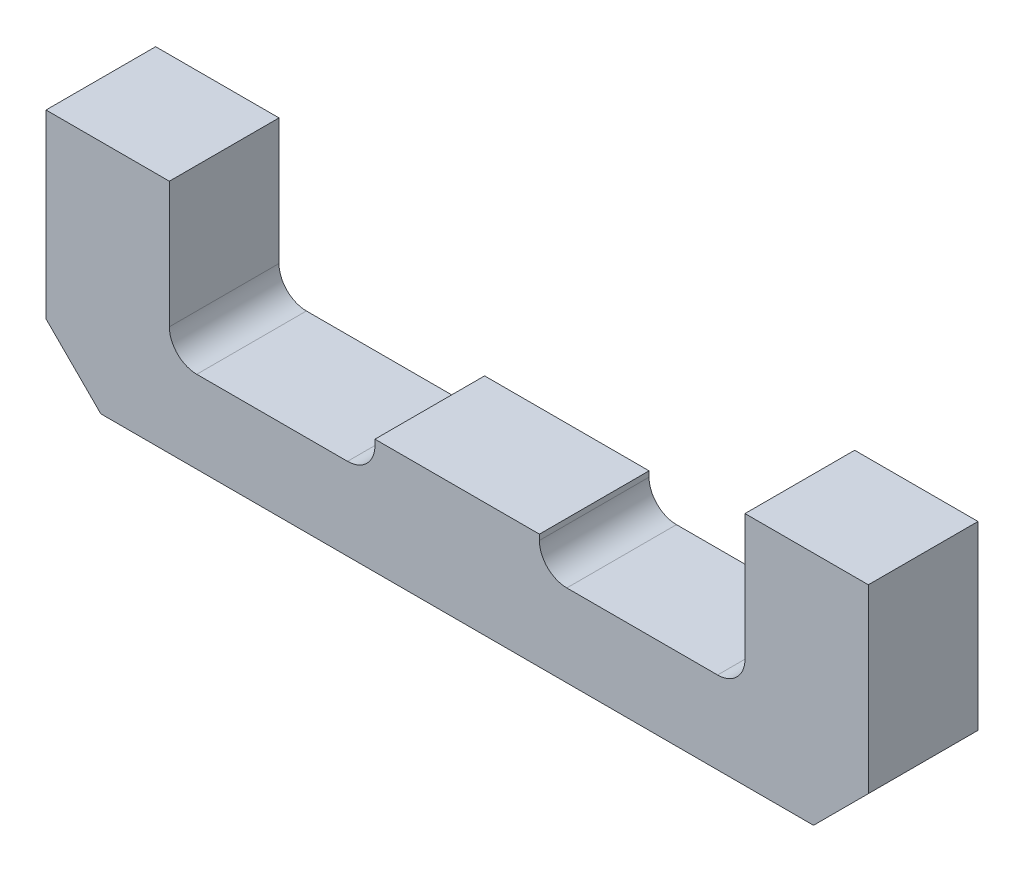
ISO-10303-21;
HEADER;
FILE_DESCRIPTION(('STEP AP214'),'2;1');
FILE_NAME('part.step','',(''),(''),'','','');
FILE_SCHEMA(('AUTOMOTIVE_DESIGN { 1 0 10303 214 1 1 1 1 }'));
ENDSEC;
DATA;
#1=APPLICATION_CONTEXT('core data for automotive mechanical design processes');
#2=APPLICATION_PROTOCOL_DEFINITION('international standard','automotive_design',2000,#1);
#3=PRODUCT_CONTEXT('',#1,'mechanical');
#4=PRODUCT('Part','Part','',(#3));
#5=PRODUCT_RELATED_PRODUCT_CATEGORY('part','',(#4));
#6=PRODUCT_DEFINITION_FORMATION('','',#4);
#7=PRODUCT_DEFINITION_CONTEXT('part definition',#1,'design');
#8=PRODUCT_DEFINITION('design','',#6,#7);
#9=PRODUCT_DEFINITION_SHAPE('','',#8);
#10=(LENGTH_UNIT() NAMED_UNIT(*) SI_UNIT(.MILLI.,.METRE.));
#11=(NAMED_UNIT(*) PLANE_ANGLE_UNIT() SI_UNIT($,.RADIAN.));
#12=(NAMED_UNIT(*) SI_UNIT($,.STERADIAN.) SOLID_ANGLE_UNIT());
#13=UNCERTAINTY_MEASURE_WITH_UNIT(LENGTH_MEASURE(1.E-05),#10,'distance_accuracy_value','');
#14=(GEOMETRIC_REPRESENTATION_CONTEXT(3) GLOBAL_UNCERTAINTY_ASSIGNED_CONTEXT((#13)) GLOBAL_UNIT_ASSIGNED_CONTEXT((#10,
#11,#12)) REPRESENTATION_CONTEXT('',''));
#15=CARTESIAN_POINT('',(0.,0.,0.));
#16=DIRECTION('',(0.,0.,1.));
#17=DIRECTION('',(1.,0.,0.));
#18=AXIS2_PLACEMENT_3D('',#15,#16,#17);
#19=CARTESIAN_POINT('',(-15.,-6.,20.));
#20=DIRECTION('',(1.,0.,0.));
#21=DIRECTION('',(0.,1.,0.));
#22=AXIS2_PLACEMENT_3D('',#19,#20,#21);
#23=PLANE('',#22);
#24=DIRECTION('',(0.,-1.,0.));
#25=VECTOR('',#24,1.);
#26=CARTESIAN_POINT('',(-15.,-6.,0.));
#27=LINE('',#26,#25);
#28=CARTESIAN_POINT('',(-15.,0.,0.));
#29=VERTEX_POINT('',#28);
#30=CARTESIAN_POINT('',(-15.,-0.999999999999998,0.));
#31=VERTEX_POINT('',#30);
#32=EDGE_CURVE('E288',#29,#31,#27,.T.);
#33=ORIENTED_EDGE('',*,*,#32,.T.);
#34=DIRECTION('',(0.,0.,-1.));
#35=VECTOR('',#34,1.);
#36=CARTESIAN_POINT('',(-15.,-0.999999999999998,20.));
#37=LINE('',#36,#35);
#38=CARTESIAN_POINT('',(-15.,-0.999999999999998,20.));
#39=VERTEX_POINT('',#38);
#40=EDGE_CURVE('E268',#31,#39,#37,.F.);
#41=ORIENTED_EDGE('',*,*,#40,.T.);
#42=DIRECTION('',(0.,-1.,0.));
#43=VECTOR('',#42,1.);
#44=CARTESIAN_POINT('',(-15.,-6.,20.));
#45=LINE('',#44,#43);
#46=CARTESIAN_POINT('',(-15.,0.,20.));
#47=VERTEX_POINT('',#46);
#48=EDGE_CURVE('E195',#47,#39,#45,.T.);
#49=ORIENTED_EDGE('',*,*,#48,.F.);
#50=DIRECTION('',(0.,0.,-1.));
#51=VECTOR('',#50,1.);
#52=CARTESIAN_POINT('',(-15.,0.,20.));
#53=LINE('',#52,#51);
#54=EDGE_CURVE('E223',#47,#29,#53,.T.);
#55=ORIENTED_EDGE('',*,*,#54,.T.);
#56=EDGE_LOOP('',(#33,#41,#49,#55));
#57=FACE_BOUND('',#56,.T.);
#58=ADVANCED_FACE('F27',(#57),#23,.F.);
#59=CARTESIAN_POINT('',(-52.5,-6.,20.));
#60=DIRECTION('',(0.,-1.,0.));
#61=DIRECTION('',(1.,0.,0.));
#62=AXIS2_PLACEMENT_3D('',#59,#60,#61);
#63=PLANE('',#62);
#64=DIRECTION('',(-1.,0.,0.));
#65=VECTOR('',#64,1.);
#66=CARTESIAN_POINT('',(-52.5,-6.,20.));
#67=LINE('',#66,#65);
#68=CARTESIAN_POINT('',(-20.,-6.,20.));
#69=VERTEX_POINT('',#68);
#70=CARTESIAN_POINT('',(-47.5,-6.,20.));
#71=VERTEX_POINT('',#70);
#72=EDGE_CURVE('E198',#69,#71,#67,.T.);
#73=ORIENTED_EDGE('',*,*,#72,.F.);
#74=DIRECTION('',(0.,0.,-1.));
#75=VECTOR('',#74,1.);
#76=CARTESIAN_POINT('',(-20.,-6.,0.));
#77=LINE('',#76,#75);
#78=CARTESIAN_POINT('',(-20.,-6.,0.));
#79=VERTEX_POINT('',#78);
#80=EDGE_CURVE('E265',#69,#79,#77,.T.);
#81=ORIENTED_EDGE('',*,*,#80,.T.);
#82=DIRECTION('',(-1.,0.,0.));
#83=VECTOR('',#82,1.);
#84=CARTESIAN_POINT('',(-52.5,-6.,0.));
#85=LINE('',#84,#83);
#86=CARTESIAN_POINT('',(-47.5,-6.,0.));
#87=VERTEX_POINT('',#86);
#88=EDGE_CURVE('E159',#79,#87,#85,.T.);
#89=ORIENTED_EDGE('',*,*,#88,.T.);
#90=DIRECTION('',(0.,0.,-1.));
#91=VECTOR('',#90,1.);
#92=CARTESIAN_POINT('',(-47.5,-6.,20.));
#93=LINE('',#92,#91);
#94=EDGE_CURVE('E263',#87,#71,#93,.F.);
#95=ORIENTED_EDGE('',*,*,#94,.T.);
#96=EDGE_LOOP('',(#73,#81,#89,#95));
#97=FACE_BOUND('',#96,.T.);
#98=ADVANCED_FACE('F286',(#97),#63,.F.);
#99=CARTESIAN_POINT('',(-52.5,22.,20.));
#100=DIRECTION('',(-1.,0.,0.));
#101=DIRECTION('',(0.,0.,1.));
#102=AXIS2_PLACEMENT_3D('',#99,#100,#101);
#103=PLANE('',#102);
#104=DIRECTION('',(0.,1.,0.));
#105=VECTOR('',#104,1.);
#106=CARTESIAN_POINT('',(-52.5,22.,20.));
#107=LINE('',#106,#105);
#108=CARTESIAN_POINT('',(-52.5,-0.99999999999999,20.));
#109=VERTEX_POINT('',#108);
#110=CARTESIAN_POINT('',(-52.5,22.,20.));
#111=VERTEX_POINT('',#110);
#112=EDGE_CURVE('E200',#109,#111,#107,.T.);
#113=ORIENTED_EDGE('',*,*,#112,.F.);
#114=DIRECTION('',(0.,0.,-1.));
#115=VECTOR('',#114,1.);
#116=CARTESIAN_POINT('',(-52.5,-0.999999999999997,0.));
#117=LINE('',#116,#115);
#118=CARTESIAN_POINT('',(-52.5,-0.99999999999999,0.));
#119=VERTEX_POINT('',#118);
#120=EDGE_CURVE('E155',#109,#119,#117,.T.);
#121=ORIENTED_EDGE('',*,*,#120,.T.);
#122=DIRECTION('',(0.,1.,0.));
#123=VECTOR('',#122,1.);
#124=CARTESIAN_POINT('',(-52.5,22.,0.));
#125=LINE('',#124,#123);
#126=CARTESIAN_POINT('',(-52.5,22.,0.));
#127=VERTEX_POINT('',#126);
#128=EDGE_CURVE('E150',#119,#127,#125,.T.);
#129=ORIENTED_EDGE('',*,*,#128,.T.);
#130=DIRECTION('',(0.,0.,-1.));
#131=VECTOR('',#130,1.);
#132=CARTESIAN_POINT('',(-52.5,22.,20.));
#133=LINE('',#132,#131);
#134=EDGE_CURVE('E153',#111,#127,#133,.T.);
#135=ORIENTED_EDGE('',*,*,#134,.F.);
#136=EDGE_LOOP('',(#113,#121,#129,#135));
#137=FACE_BOUND('',#136,.T.);
#138=ADVANCED_FACE('F152',(#137),#103,.F.);
#139=CARTESIAN_POINT('',(-75.,22.,20.));
#140=DIRECTION('',(0.,-1.,0.));
#141=DIRECTION('',(1.,0.,0.));
#142=AXIS2_PLACEMENT_3D('',#139,#140,#141);
#143=PLANE('',#142);
#144=DIRECTION('',(-1.,0.,0.));
#145=VECTOR('',#144,1.);
#146=CARTESIAN_POINT('',(-75.,22.,0.));
#147=LINE('',#146,#145);
#148=CARTESIAN_POINT('',(-75.,22.,0.));
#149=VERTEX_POINT('',#148);
#150=EDGE_CURVE('E158',#127,#149,#147,.T.);
#151=ORIENTED_EDGE('',*,*,#150,.T.);
#152=DIRECTION('',(0.,0.,-1.));
#153=VECTOR('',#152,1.);
#154=CARTESIAN_POINT('',(-75.,22.,20.));
#155=LINE('',#154,#153);
#156=CARTESIAN_POINT('',(-75.,22.,20.));
#157=VERTEX_POINT('',#156);
#158=EDGE_CURVE('E167',#157,#149,#155,.T.);
#159=ORIENTED_EDGE('',*,*,#158,.F.);
#160=DIRECTION('',(-1.,0.,0.));
#161=VECTOR('',#160,1.);
#162=CARTESIAN_POINT('',(-75.,22.,20.));
#163=LINE('',#162,#161);
#164=EDGE_CURVE('E165',#111,#157,#163,.T.);
#165=ORIENTED_EDGE('',*,*,#164,.F.);
#166=ORIENTED_EDGE('',*,*,#134,.T.);
#167=EDGE_LOOP('',(#151,#159,#165,#166));
#168=FACE_BOUND('',#167,.T.);
#169=ADVANCED_FACE('F162',(#168),#143,.F.);
#170=CARTESIAN_POINT('',(-75.,-21.,20.));
#171=DIRECTION('',(1.,0.,0.));
#172=DIRECTION('',(0.,0.,-1.));
#173=AXIS2_PLACEMENT_3D('',#170,#171,#172);
#174=PLANE('',#173);
#175=DIRECTION('',(0.,-1.,0.));
#176=VECTOR('',#175,1.);
#177=CARTESIAN_POINT('',(-75.,-21.,0.));
#178=LINE('',#177,#176);
#179=CARTESIAN_POINT('',(-75.,-11.,0.));
#180=VERTEX_POINT('',#179);
#181=EDGE_CURVE('E173',#149,#180,#178,.T.);
#182=ORIENTED_EDGE('',*,*,#181,.T.);
#183=DIRECTION('',(0.,0.,1.));
#184=VECTOR('',#183,1.);
#185=CARTESIAN_POINT('',(-75.,-11.,20.));
#186=LINE('',#185,#184);
#187=CARTESIAN_POINT('',(-75.,-11.,20.));
#188=VERTEX_POINT('',#187);
#189=EDGE_CURVE('E251',#180,#188,#186,.T.);
#190=ORIENTED_EDGE('',*,*,#189,.T.);
#191=DIRECTION('',(0.,-1.,0.));
#192=VECTOR('',#191,1.);
#193=CARTESIAN_POINT('',(-75.,-21.,20.));
#194=LINE('',#193,#192);
#195=EDGE_CURVE('E203',#157,#188,#194,.T.);
#196=ORIENTED_EDGE('',*,*,#195,.F.);
#197=ORIENTED_EDGE('',*,*,#158,.T.);
#198=EDGE_LOOP('',(#182,#190,#196,#197));
#199=FACE_BOUND('',#198,.T.);
#200=ADVANCED_FACE('F364',(#199),#174,.F.);
#201=CARTESIAN_POINT('',(75.,-21.,20.));
#202=DIRECTION('',(0.,1.,0.));
#203=DIRECTION('',(0.,0.,1.));
#204=AXIS2_PLACEMENT_3D('',#201,#202,#203);
#205=PLANE('',#204);
#206=DIRECTION('',(1.,0.,0.));
#207=VECTOR('',#206,1.);
#208=CARTESIAN_POINT('',(75.,-21.,0.));
#209=LINE('',#208,#207);
#210=CARTESIAN_POINT('',(-65.,-21.,0.));
#211=VERTEX_POINT('',#210);
#212=CARTESIAN_POINT('',(65.,-21.,0.));
#213=VERTEX_POINT('',#212);
#214=EDGE_CURVE('E175',#211,#213,#209,.T.);
#215=ORIENTED_EDGE('',*,*,#214,.T.);
#216=DIRECTION('',(0.,0.,1.));
#217=VECTOR('',#216,1.);
#218=CARTESIAN_POINT('',(65.,-21.,20.));
#219=LINE('',#218,#217);
#220=CARTESIAN_POINT('',(65.,-21.,20.));
#221=VERTEX_POINT('',#220);
#222=EDGE_CURVE('E245',#213,#221,#219,.T.);
#223=ORIENTED_EDGE('',*,*,#222,.T.);
#224=DIRECTION('',(1.,0.,0.));
#225=VECTOR('',#224,1.);
#226=CARTESIAN_POINT('',(75.,-21.,20.));
#227=LINE('',#226,#225);
#228=CARTESIAN_POINT('',(-65.,-21.,20.));
#229=VERTEX_POINT('',#228);
#230=EDGE_CURVE('E206',#229,#221,#227,.T.);
#231=ORIENTED_EDGE('',*,*,#230,.F.);
#232=DIRECTION('',(0.,0.,-1.));
#233=VECTOR('',#232,1.);
#234=CARTESIAN_POINT('',(-65.,-21.,20.));
#235=LINE('',#234,#233);
#236=EDGE_CURVE('E242',#229,#211,#235,.T.);
#237=ORIENTED_EDGE('',*,*,#236,.T.);
#238=EDGE_LOOP('',(#215,#223,#231,#237));
#239=FACE_BOUND('',#238,.T.);
#240=ADVANCED_FACE('F356',(#239),#205,.F.);
#241=CARTESIAN_POINT('',(75.,22.,20.));
#242=DIRECTION('',(-1.,0.,0.));
#243=DIRECTION('',(0.,0.,1.));
#244=AXIS2_PLACEMENT_3D('',#241,#242,#243);
#245=PLANE('',#244);
#246=DIRECTION('',(0.,1.,0.));
#247=VECTOR('',#246,1.);
#248=CARTESIAN_POINT('',(75.,22.,20.));
#249=LINE('',#248,#247);
#250=CARTESIAN_POINT('',(75.,-11.,20.));
#251=VERTEX_POINT('',#250);
#252=CARTESIAN_POINT('',(75.,22.,20.));
#253=VERTEX_POINT('',#252);
#254=EDGE_CURVE('E209',#251,#253,#249,.T.);
#255=ORIENTED_EDGE('',*,*,#254,.F.);
#256=DIRECTION('',(0.,0.,-1.));
#257=VECTOR('',#256,1.);
#258=CARTESIAN_POINT('',(75.,-11.,20.));
#259=LINE('',#258,#257);
#260=CARTESIAN_POINT('',(75.,-11.,0.));
#261=VERTEX_POINT('',#260);
#262=EDGE_CURVE('E166',#251,#261,#259,.T.);
#263=ORIENTED_EDGE('',*,*,#262,.T.);
#264=DIRECTION('',(0.,1.,0.));
#265=VECTOR('',#264,1.);
#266=CARTESIAN_POINT('',(75.,22.,0.));
#267=LINE('',#266,#265);
#268=CARTESIAN_POINT('',(75.,22.,0.));
#269=VERTEX_POINT('',#268);
#270=EDGE_CURVE('E181',#261,#269,#267,.T.);
#271=ORIENTED_EDGE('',*,*,#270,.T.);
#272=DIRECTION('',(0.,0.,-1.));
#273=VECTOR('',#272,1.);
#274=CARTESIAN_POINT('',(75.,22.,20.));
#275=LINE('',#274,#273);
#276=EDGE_CURVE('E232',#253,#269,#275,.T.);
#277=ORIENTED_EDGE('',*,*,#276,.F.);
#278=EDGE_LOOP('',(#255,#263,#271,#277));
#279=FACE_BOUND('',#278,.T.);
#280=ADVANCED_FACE('F348',(#279),#245,.F.);
#281=CARTESIAN_POINT('',(52.5,22.,20.));
#282=DIRECTION('',(0.,-1.,0.));
#283=DIRECTION('',(1.,0.,0.));
#284=AXIS2_PLACEMENT_3D('',#281,#282,#283);
#285=PLANE('',#284);
#286=DIRECTION('',(-1.,0.,0.));
#287=VECTOR('',#286,1.);
#288=CARTESIAN_POINT('',(52.5,22.,0.));
#289=LINE('',#288,#287);
#290=CARTESIAN_POINT('',(52.5,22.,0.));
#291=VERTEX_POINT('',#290);
#292=EDGE_CURVE('E183',#269,#291,#289,.T.);
#293=ORIENTED_EDGE('',*,*,#292,.T.);
#294=DIRECTION('',(0.,0.,-1.));
#295=VECTOR('',#294,1.);
#296=CARTESIAN_POINT('',(52.5,22.,20.));
#297=LINE('',#296,#295);
#298=CARTESIAN_POINT('',(52.5,22.,20.));
#299=VERTEX_POINT('',#298);
#300=EDGE_CURVE('E229',#299,#291,#297,.T.);
#301=ORIENTED_EDGE('',*,*,#300,.F.);
#302=DIRECTION('',(-1.,0.,0.));
#303=VECTOR('',#302,1.);
#304=CARTESIAN_POINT('',(52.5,22.,20.));
#305=LINE('',#304,#303);
#306=EDGE_CURVE('E211',#253,#299,#305,.T.);
#307=ORIENTED_EDGE('',*,*,#306,.F.);
#308=ORIENTED_EDGE('',*,*,#276,.T.);
#309=EDGE_LOOP('',(#293,#301,#307,#308));
#310=FACE_BOUND('',#309,.T.);
#311=ADVANCED_FACE('F343',(#310),#285,.F.);
#312=CARTESIAN_POINT('',(52.5,-6.,20.));
#313=DIRECTION('',(1.,0.,0.));
#314=DIRECTION('',(0.,0.,-1.));
#315=AXIS2_PLACEMENT_3D('',#312,#313,#314);
#316=PLANE('',#315);
#317=DIRECTION('',(0.,-1.,0.));
#318=VECTOR('',#317,1.);
#319=CARTESIAN_POINT('',(52.5,-6.,0.));
#320=LINE('',#319,#318);
#321=CARTESIAN_POINT('',(52.5,-1.,0.));
#322=VERTEX_POINT('',#321);
#323=EDGE_CURVE('E185',#291,#322,#320,.T.);
#324=ORIENTED_EDGE('',*,*,#323,.T.);
#325=DIRECTION('',(0.,0.,-1.));
#326=VECTOR('',#325,1.);
#327=CARTESIAN_POINT('',(52.5,-0.999999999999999,20.));
#328=LINE('',#327,#326);
#329=CARTESIAN_POINT('',(52.5,-1.,20.));
#330=VERTEX_POINT('',#329);
#331=EDGE_CURVE('E258',#322,#330,#328,.F.);
#332=ORIENTED_EDGE('',*,*,#331,.T.);
#333=DIRECTION('',(0.,-1.,0.));
#334=VECTOR('',#333,1.);
#335=CARTESIAN_POINT('',(52.5,-6.,20.));
#336=LINE('',#335,#334);
#337=EDGE_CURVE('E213',#299,#330,#336,.T.);
#338=ORIENTED_EDGE('',*,*,#337,.F.);
#339=ORIENTED_EDGE('',*,*,#300,.T.);
#340=EDGE_LOOP('',(#324,#332,#338,#339));
#341=FACE_BOUND('',#340,.T.);
#342=ADVANCED_FACE('F339',(#341),#316,.F.);
#343=CARTESIAN_POINT('',(15.,-6.,20.));
#344=DIRECTION('',(0.,-1.,0.));
#345=DIRECTION('',(1.,0.,0.));
#346=AXIS2_PLACEMENT_3D('',#343,#344,#345);
#347=PLANE('',#346);
#348=DIRECTION('',(-1.,0.,0.));
#349=VECTOR('',#348,1.);
#350=CARTESIAN_POINT('',(15.,-6.,20.));
#351=LINE('',#350,#349);
#352=CARTESIAN_POINT('',(47.5,-6.,20.));
#353=VERTEX_POINT('',#352);
#354=CARTESIAN_POINT('',(20.,-6.,20.));
#355=VERTEX_POINT('',#354);
#356=EDGE_CURVE('E216',#353,#355,#351,.T.);
#357=ORIENTED_EDGE('',*,*,#356,.F.);
#358=DIRECTION('',(0.,0.,-1.));
#359=VECTOR('',#358,1.);
#360=CARTESIAN_POINT('',(47.5,-6.,0.));
#361=LINE('',#360,#359);
#362=CARTESIAN_POINT('',(47.5,-6.,0.));
#363=VERTEX_POINT('',#362);
#364=EDGE_CURVE('E255',#353,#363,#361,.T.);
#365=ORIENTED_EDGE('',*,*,#364,.T.);
#366=DIRECTION('',(-1.,0.,0.));
#367=VECTOR('',#366,1.);
#368=CARTESIAN_POINT('',(15.,-6.,0.));
#369=LINE('',#368,#367);
#370=CARTESIAN_POINT('',(20.,-6.,0.));
#371=VERTEX_POINT('',#370);
#372=EDGE_CURVE('E188',#363,#371,#369,.T.);
#373=ORIENTED_EDGE('',*,*,#372,.T.);
#374=DIRECTION('',(0.,0.,-1.));
#375=VECTOR('',#374,1.);
#376=CARTESIAN_POINT('',(20.,-6.,20.));
#377=LINE('',#376,#375);
#378=EDGE_CURVE('E253',#371,#355,#377,.F.);
#379=ORIENTED_EDGE('',*,*,#378,.T.);
#380=EDGE_LOOP('',(#357,#365,#373,#379));
#381=FACE_BOUND('',#380,.T.);
#382=ADVANCED_FACE('F329',(#381),#347,.F.);
#383=CARTESIAN_POINT('',(15.,0.,20.));
#384=DIRECTION('',(-1.,0.,0.));
#385=DIRECTION('',(0.,-1.,0.));
#386=AXIS2_PLACEMENT_3D('',#383,#384,#385);
#387=PLANE('',#386);
#388=DIRECTION('',(0.,1.,0.));
#389=VECTOR('',#388,1.);
#390=CARTESIAN_POINT('',(15.,0.,20.));
#391=LINE('',#390,#389);
#392=CARTESIAN_POINT('',(15.,-0.999999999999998,20.));
#393=VERTEX_POINT('',#392);
#394=CARTESIAN_POINT('',(15.,0.,20.));
#395=VERTEX_POINT('',#394);
#396=EDGE_CURVE('E219',#393,#395,#391,.T.);
#397=ORIENTED_EDGE('',*,*,#396,.F.);
#398=DIRECTION('',(0.,0.,-1.));
#399=VECTOR('',#398,1.);
#400=CARTESIAN_POINT('',(15.,-0.999999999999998,0.));
#401=LINE('',#400,#399);
#402=CARTESIAN_POINT('',(15.,-0.999999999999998,0.));
#403=VERTEX_POINT('',#402);
#404=EDGE_CURVE('E260',#393,#403,#401,.T.);
#405=ORIENTED_EDGE('',*,*,#404,.T.);
#406=DIRECTION('',(0.,1.,0.));
#407=VECTOR('',#406,1.);
#408=CARTESIAN_POINT('',(15.,0.,0.));
#409=LINE('',#408,#407);
#410=CARTESIAN_POINT('',(15.,0.,0.));
#411=VERTEX_POINT('',#410);
#412=EDGE_CURVE('E191',#403,#411,#409,.T.);
#413=ORIENTED_EDGE('',*,*,#412,.T.);
#414=DIRECTION('',(0.,0.,-1.));
#415=VECTOR('',#414,1.);
#416=CARTESIAN_POINT('',(15.,0.,20.));
#417=LINE('',#416,#415);
#418=EDGE_CURVE('E226',#395,#411,#417,.T.);
#419=ORIENTED_EDGE('',*,*,#418,.F.);
#420=EDGE_LOOP('',(#397,#405,#413,#419));
#421=FACE_BOUND('',#420,.T.);
#422=ADVANCED_FACE('F322',(#421),#387,.F.);
#423=CARTESIAN_POINT('',(-15.,0.,20.));
#424=DIRECTION('',(0.,-1.,0.));
#425=DIRECTION('',(0.,0.,-1.));
#426=AXIS2_PLACEMENT_3D('',#423,#424,#425);
#427=PLANE('',#426);
#428=DIRECTION('',(-1.,0.,0.));
#429=VECTOR('',#428,1.);
#430=CARTESIAN_POINT('',(-15.,0.,0.));
#431=LINE('',#430,#429);
#432=EDGE_CURVE('E193',#411,#29,#431,.T.);
#433=ORIENTED_EDGE('',*,*,#432,.T.);
#434=ORIENTED_EDGE('',*,*,#54,.F.);
#435=DIRECTION('',(-1.,0.,0.));
#436=VECTOR('',#435,1.);
#437=CARTESIAN_POINT('',(-15.,0.,20.));
#438=LINE('',#437,#436);
#439=EDGE_CURVE('E221',#395,#47,#438,.T.);
#440=ORIENTED_EDGE('',*,*,#439,.F.);
#441=ORIENTED_EDGE('',*,*,#418,.T.);
#442=EDGE_LOOP('',(#433,#434,#440,#441));
#443=FACE_BOUND('',#442,.T.);
#444=ADVANCED_FACE('F318',(#443),#427,.F.);
#445=CARTESIAN_POINT('',(-15.,22.,20.));
#446=DIRECTION('',(0.,0.,-1.));
#447=DIRECTION('',(-1.,0.,0.));
#448=AXIS2_PLACEMENT_3D('',#445,#446,#447);
#449=PLANE('',#448);
#450=ORIENTED_EDGE('',*,*,#230,.T.);
#451=DIRECTION('',(-0.707106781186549,-0.707106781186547,0.));
#452=VECTOR('',#451,1.);
#453=CARTESIAN_POINT('',(75.,-11.,20.));
#454=LINE('',#453,#452);
#455=EDGE_CURVE('E249',#221,#251,#454,.F.);
#456=ORIENTED_EDGE('',*,*,#455,.T.);
#457=ORIENTED_EDGE('',*,*,#254,.T.);
#458=ORIENTED_EDGE('',*,*,#306,.T.);
#459=ORIENTED_EDGE('',*,*,#337,.T.);
#460=CARTESIAN_POINT('',(47.5,-0.999999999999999,20.));
#461=DIRECTION('',(0.,0.,-1.));
#462=DIRECTION('',(-1.,0.,0.));
#463=AXIS2_PLACEMENT_3D('',#460,#461,#462);
#464=CIRCLE('',#463,5.);
#465=EDGE_CURVE('E273',#330,#353,#464,.T.);
#466=ORIENTED_EDGE('',*,*,#465,.T.);
#467=ORIENTED_EDGE('',*,*,#356,.T.);
#468=CARTESIAN_POINT('',(20.,-1.,20.));
#469=DIRECTION('',(0.,0.,-1.));
#470=DIRECTION('',(-1.,0.,0.));
#471=AXIS2_PLACEMENT_3D('',#468,#469,#470);
#472=CIRCLE('',#471,5.);
#473=EDGE_CURVE('E277',#355,#393,#472,.T.);
#474=ORIENTED_EDGE('',*,*,#473,.T.);
#475=ORIENTED_EDGE('',*,*,#396,.T.);
#476=ORIENTED_EDGE('',*,*,#439,.T.);
#477=ORIENTED_EDGE('',*,*,#48,.T.);
#478=CARTESIAN_POINT('',(-20.,-1.,20.));
#479=DIRECTION('',(0.,0.,-1.));
#480=DIRECTION('',(-1.,0.,0.));
#481=AXIS2_PLACEMENT_3D('',#478,#479,#480);
#482=CIRCLE('',#481,5.);
#483=EDGE_CURVE('E281',#39,#69,#482,.T.);
#484=ORIENTED_EDGE('',*,*,#483,.T.);
#485=ORIENTED_EDGE('',*,*,#72,.T.);
#486=CARTESIAN_POINT('',(-47.5,-0.999999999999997,20.));
#487=DIRECTION('',(0.,0.,-1.));
#488=DIRECTION('',(-1.,0.,0.));
#489=AXIS2_PLACEMENT_3D('',#486,#487,#488);
#490=CIRCLE('',#489,5.);
#491=EDGE_CURVE('E11',#71,#109,#490,.T.);
#492=ORIENTED_EDGE('',*,*,#491,.T.);
#493=ORIENTED_EDGE('',*,*,#112,.T.);
#494=ORIENTED_EDGE('',*,*,#164,.T.);
#495=ORIENTED_EDGE('',*,*,#195,.T.);
#496=DIRECTION('',(-0.707106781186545,0.70710678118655,0.));
#497=VECTOR('',#496,1.);
#498=CARTESIAN_POINT('',(-65.,-21.,20.));
#499=LINE('',#498,#497);
#500=EDGE_CURVE('E247',#188,#229,#499,.F.);
#501=ORIENTED_EDGE('',*,*,#500,.T.);
#502=EDGE_LOOP('',(#450,#456,#457,#458,#459,#466,#467,#474,#475,#476,#477,#484,#485,#492,#493,
#494,#495,#501));
#503=FACE_BOUND('',#502,.T.);
#504=ADVANCED_FACE('F313',(#503),#449,.F.);
#505=CARTESIAN_POINT('',(-15.,22.,0.));
#506=DIRECTION('',(0.,0.,-1.));
#507=DIRECTION('',(-1.,0.,0.));
#508=AXIS2_PLACEMENT_3D('',#505,#506,#507);
#509=PLANE('',#508);
#510=ORIENTED_EDGE('',*,*,#270,.F.);
#511=DIRECTION('',(0.707106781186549,0.707106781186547,0.));
#512=VECTOR('',#511,1.);
#513=CARTESIAN_POINT('',(46.4999999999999,-39.5000000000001,0.));
#514=LINE('',#513,#512);
#515=EDGE_CURVE('E240',#261,#213,#514,.F.);
#516=ORIENTED_EDGE('',*,*,#515,.T.);
#517=ORIENTED_EDGE('',*,*,#214,.F.);
#518=DIRECTION('',(0.707106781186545,-0.70710678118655,0.));
#519=VECTOR('',#518,1.);
#520=CARTESIAN_POINT('',(-61.5000000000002,-24.4999999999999,0.));
#521=LINE('',#520,#519);
#522=EDGE_CURVE('E238',#211,#180,#521,.F.);
#523=ORIENTED_EDGE('',*,*,#522,.T.);
#524=ORIENTED_EDGE('',*,*,#181,.F.);
#525=ORIENTED_EDGE('',*,*,#150,.F.);
#526=ORIENTED_EDGE('',*,*,#128,.F.);
#527=CARTESIAN_POINT('',(-47.5,-0.999999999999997,0.));
#528=DIRECTION('',(0.,0.,-1.));
#529=DIRECTION('',(-1.,0.,0.));
#530=AXIS2_PLACEMENT_3D('',#527,#528,#529);
#531=CIRCLE('',#530,5.);
#532=EDGE_CURVE('E34',#119,#87,#531,.F.);
#533=ORIENTED_EDGE('',*,*,#532,.T.);
#534=ORIENTED_EDGE('',*,*,#88,.F.);
#535=CARTESIAN_POINT('',(-20.,-1.,0.));
#536=DIRECTION('',(0.,0.,-1.));
#537=DIRECTION('',(-1.,0.,0.));
#538=AXIS2_PLACEMENT_3D('',#535,#536,#537);
#539=CIRCLE('',#538,5.);
#540=EDGE_CURVE('E279',#79,#31,#539,.F.);
#541=ORIENTED_EDGE('',*,*,#540,.T.);
#542=ORIENTED_EDGE('',*,*,#32,.F.);
#543=ORIENTED_EDGE('',*,*,#432,.F.);
#544=ORIENTED_EDGE('',*,*,#412,.F.);
#545=CARTESIAN_POINT('',(20.,-1.,0.));
#546=DIRECTION('',(0.,0.,-1.));
#547=DIRECTION('',(-1.,0.,0.));
#548=AXIS2_PLACEMENT_3D('',#545,#546,#547);
#549=CIRCLE('',#548,5.);
#550=EDGE_CURVE('E275',#403,#371,#549,.F.);
#551=ORIENTED_EDGE('',*,*,#550,.T.);
#552=ORIENTED_EDGE('',*,*,#372,.F.);
#553=CARTESIAN_POINT('',(47.5,-0.999999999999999,0.));
#554=DIRECTION('',(0.,0.,-1.));
#555=DIRECTION('',(-1.,0.,0.));
#556=AXIS2_PLACEMENT_3D('',#553,#554,#555);
#557=CIRCLE('',#556,5.);
#558=EDGE_CURVE('E271',#363,#322,#557,.F.);
#559=ORIENTED_EDGE('',*,*,#558,.T.);
#560=ORIENTED_EDGE('',*,*,#323,.F.);
#561=ORIENTED_EDGE('',*,*,#292,.F.);
#562=EDGE_LOOP('',(#510,#516,#517,#523,#524,#525,#526,#533,#534,#541,#542,#543,#544,#551,#552,
#559,#560,#561));
#563=FACE_BOUND('',#562,.T.);
#564=ADVANCED_FACE('F171',(#563),#509,.T.);
#565=CARTESIAN_POINT('',(75.,-11.,20.));
#566=DIRECTION('',(-0.707106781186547,0.707106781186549,0.));
#567=DIRECTION('',(-0.707106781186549,-0.707106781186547,0.));
#568=AXIS2_PLACEMENT_3D('',#565,#566,#567);
#569=PLANE('',#568);
#570=ORIENTED_EDGE('',*,*,#455,.F.);
#571=ORIENTED_EDGE('',*,*,#222,.F.);
#572=ORIENTED_EDGE('',*,*,#515,.F.);
#573=ORIENTED_EDGE('',*,*,#262,.F.);
#574=EDGE_LOOP('',(#570,#571,#572,#573));
#575=FACE_BOUND('',#574,.T.);
#576=ADVANCED_FACE('F352',(#575),#569,.F.);
#577=CARTESIAN_POINT('',(-65.,-21.,20.));
#578=DIRECTION('',(0.70710678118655,0.707106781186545,0.));
#579=DIRECTION('',(-0.707106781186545,0.70710678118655,0.));
#580=AXIS2_PLACEMENT_3D('',#577,#578,#579);
#581=PLANE('',#580);
#582=ORIENTED_EDGE('',*,*,#500,.F.);
#583=ORIENTED_EDGE('',*,*,#189,.F.);
#584=ORIENTED_EDGE('',*,*,#522,.F.);
#585=ORIENTED_EDGE('',*,*,#236,.F.);
#586=EDGE_LOOP('',(#582,#583,#584,#585));
#587=FACE_BOUND('',#586,.T.);
#588=ADVANCED_FACE('F362',(#587),#581,.F.);
#589=CARTESIAN_POINT('',(47.5,-0.999999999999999,20.));
#590=DIRECTION('',(0.,0.,1.));
#591=DIRECTION('',(1.,0.,0.));
#592=AXIS2_PLACEMENT_3D('',#589,#590,#591);
#593=CYLINDRICAL_SURFACE('',#592,5.);
#594=ORIENTED_EDGE('',*,*,#465,.F.);
#595=ORIENTED_EDGE('',*,*,#331,.F.);
#596=ORIENTED_EDGE('',*,*,#558,.F.);
#597=ORIENTED_EDGE('',*,*,#364,.F.);
#598=EDGE_LOOP('',(#594,#595,#596,#597));
#599=FACE_BOUND('',#598,.T.);
#600=ADVANCED_FACE('F335',(#599),#593,.F.);
#601=CARTESIAN_POINT('',(20.,-1.,20.));
#602=DIRECTION('',(0.,0.,1.));
#603=DIRECTION('',(1.,0.,0.));
#604=AXIS2_PLACEMENT_3D('',#601,#602,#603);
#605=CYLINDRICAL_SURFACE('',#604,5.);
#606=ORIENTED_EDGE('',*,*,#473,.F.);
#607=ORIENTED_EDGE('',*,*,#378,.F.);
#608=ORIENTED_EDGE('',*,*,#550,.F.);
#609=ORIENTED_EDGE('',*,*,#404,.F.);
#610=EDGE_LOOP('',(#606,#607,#608,#609));
#611=FACE_BOUND('',#610,.T.);
#612=ADVANCED_FACE('F296',(#611),#605,.F.);
#613=CARTESIAN_POINT('',(-20.,-1.,20.));
#614=DIRECTION('',(0.,0.,1.));
#615=DIRECTION('',(1.,0.,0.));
#616=AXIS2_PLACEMENT_3D('',#613,#614,#615);
#617=CYLINDRICAL_SURFACE('',#616,5.);
#618=ORIENTED_EDGE('',*,*,#483,.F.);
#619=ORIENTED_EDGE('',*,*,#40,.F.);
#620=ORIENTED_EDGE('',*,*,#540,.F.);
#621=ORIENTED_EDGE('',*,*,#80,.F.);
#622=EDGE_LOOP('',(#618,#619,#620,#621));
#623=FACE_BOUND('',#622,.T.);
#624=ADVANCED_FACE('F291',(#623),#617,.F.);
#625=CARTESIAN_POINT('',(-47.5,-0.999999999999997,20.));
#626=DIRECTION('',(0.,0.,1.));
#627=DIRECTION('',(1.,0.,0.));
#628=AXIS2_PLACEMENT_3D('',#625,#626,#627);
#629=CYLINDRICAL_SURFACE('',#628,5.);
#630=ORIENTED_EDGE('',*,*,#491,.F.);
#631=ORIENTED_EDGE('',*,*,#94,.F.);
#632=ORIENTED_EDGE('',*,*,#532,.F.);
#633=ORIENTED_EDGE('',*,*,#120,.F.);
#634=EDGE_LOOP('',(#630,#631,#632,#633));
#635=FACE_BOUND('',#634,.T.);
#636=ADVANCED_FACE('F289',(#635),#629,.F.);
#637=CLOSED_SHELL('',(#58,#98,#138,#169,#200,#240,#280,#311,#342,#382,#422,#444,#504,#564,#576,
#588,#600,#612,#624,#636));
#638=MANIFOLD_SOLID_BREP('B2',#637);
#639=ADVANCED_BREP_SHAPE_REPRESENTATION('',(#18,#638),#14);
#640=SHAPE_DEFINITION_REPRESENTATION(#9,#639);
ENDSEC;
END-ISO-10303-21;
